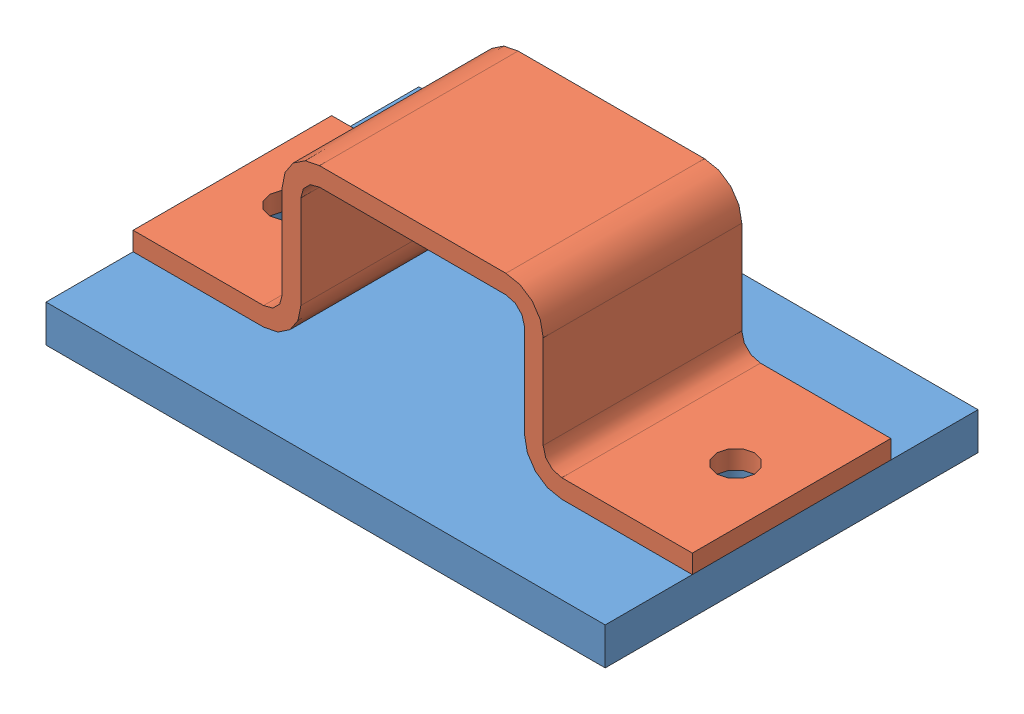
SolidWorks assembly replace components.SLDASM, configuration Default (file format 4400). Lengths in mm.
Overall size (150 55 100).
2 component instances, 2 part files, 4 mates.
Components (placement in the parent):
- Plate-1: Plate.SLDPRT [Default] at origin size (150 10 100)
- support-1: support.SLDPRT [Default] at (0 10 0) x (-1 0 0) z (0 1 0) size (150 53.27 45)
Mates (geometry in assembly coordinates):
- Inplace1: in place: plane of Plate-1; plane of support-1; moOrthogonalPlaneRef_w of Plate-1; plane of support-1; moOrthogonalPlaneRef_w of Plate-1; plane of support-1
- Coincident1: coincident aligned: plane of Plate-1; plane of support-1
- Coincident2: coincident aligned: moOrthogonalPlaneRef_w of Plate-1; plane of support-1
- Coincident3: coincident anti-aligned: moOrthogonalPlaneRef_w of Plate-1; plane of support-1
